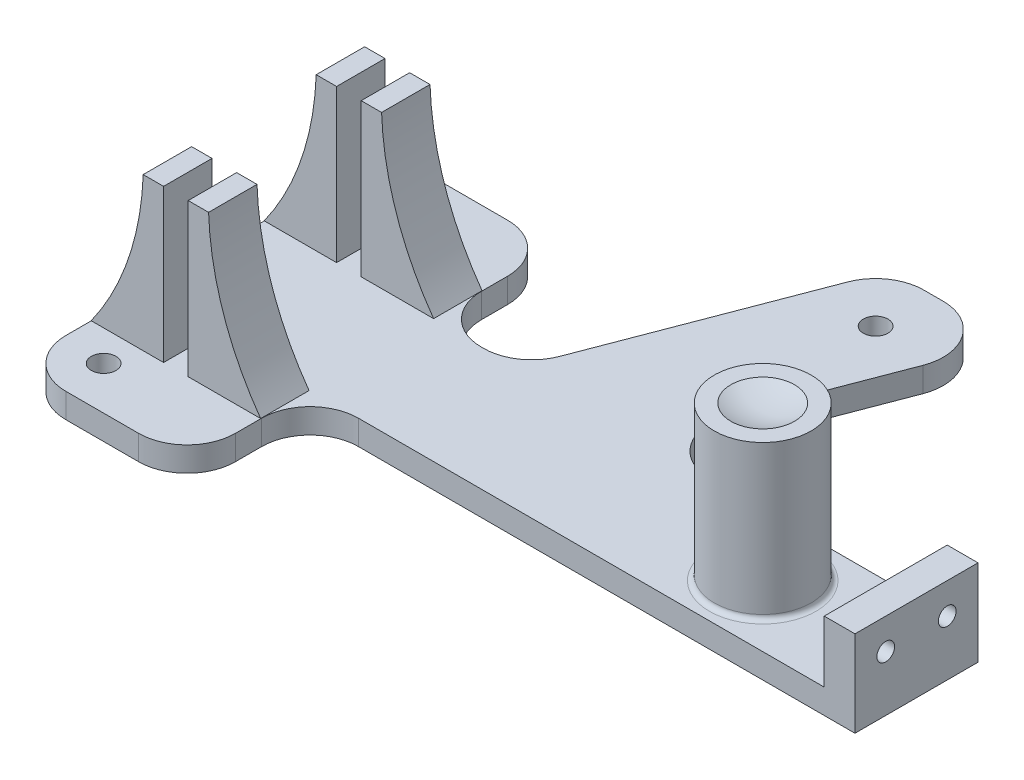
from build123d import *

# Parameters (mm, degrees)
BOSS_EXTRUDE1_DEPTH       = 5.08
BOSS_EXTRUDE2_DEPTH       = 10
SKETCH3_R                 = 10
BOSS_EXTRUDE3_DEPTH       = 31.75
FILLET1_R                 = 1
BOSS_EXTRUDE5_DEPTH       = 5.08
FILLET2_R                 = 10
FILLET3_R                 = 10
SKETCH9_W                 = 6.35
SKETCH9_H                 = 25.4
BOSS_EXTRUDE6_DEPTH       = 12.7
F_6_CLEARANCE_HOLE1_D     = 3.6576
F_6_CLEARANCE_HOLE1_DEPTH = 6.35
CUT_EXTRUDE1_REACH        = 155.752
SKETCH17_R                = 2.54


with BuildPart() as part:
    # Sketch1 → Boss-Extrude1 (new body)
    with BuildSketch(Plane(origin=(0, 0, 0), x_dir=(1, 0, 0), z_dir=(0, 1, 0))):
        with BuildLine():
            Line((20.08, 28.1), (20.08, 22.7))
            ThreePointArc((20.08, 22.7), (23.008932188, 15.628932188), (30.08, 12.7))
            Line((30.08, 12.7), (126.24, 12.7))
            Line((126.24, 12.7), (132.59, 12.7))
            Line((132.59, 12.7), (132.59, 0))
            Line((132.59, 0), (132.59, -12.7))
            Line((132.59, -12.7), (126.24, -12.7))
            Line((126.24, -12.7), (30.08, -12.7))
            ThreePointArc((30.08, -12.7), (23.008932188, -15.628932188), (20.08, -22.7))
            Line((20.08, -22.7), (20.08, -28.1))
            ThreePointArc((20.08, -28.1), (17.151067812, -35.171067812), (10.08, -38.1))
            Line((10.08, -38.1), (-4.92, -38.1))
            ThreePointArc((-4.92, -38.1), (-11.991067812, -35.171067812), (-14.92, -28.1))
            Line((-14.92, -28.1), (-14.92, 28.1))
            ThreePointArc((-14.92, 28.1), (-11.991067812, 35.171067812), (-4.92, 38.1))
            Line((-4.92, 38.1), (10.08, 38.1))
            ThreePointArc((10.08, 38.1), (17.151067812, 35.171067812), (20.08, 28.1))
        make_face()
    extrude(amount=-BOSS_EXTRUDE1_DEPTH)

    # Sketch2 → Boss-Extrude2 (add)
    with BuildSketch(Plane.XY.offset(22.86)):
        with BuildLine():
            Line((0, 0), (-14.953299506, 0))
            ThreePointArc((-14.953299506, 0), (-7.255141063, 14.95657571), (-4.209502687, 31.5))
            Line((-4.209502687, 31.5), (0, 31.5))
            Line((0, 31.5), (0, 0))
        make_face()
        with BuildLine():
            Line((5.08, 0), (20.033299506, 0))
            ThreePointArc((20.033299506, 0), (12.335141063, 14.95657571), (9.289502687, 31.5))
            Line((9.289502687, 31.5), (5.08, 31.5))
            Line((5.08, 31.5), (5.08, 0))
        make_face()
    boss_extrude2 = extrude(amount=-BOSS_EXTRUDE2_DEPTH)

    # Mirror1: Boss-Extrude2 across plane
    add(boss_extrude2.mirror(Plane.XY))

    # Sketch3 → Boss-Extrude3 (add)
    with BuildSketch(Plane(origin=(0, 0, 0), x_dir=(1, 0, 0), z_dir=(0, 1, 0))):
        with Locations(Location((100.84, 0, 0), (0, 0, 270))):
            Circle(SKETCH3_R)
    extrude(amount=BOSS_EXTRUDE3_DEPTH)

    # Fillet1
    fillet1_edges = [part.edges().sort_by_distance(p)[0] for p in [
        (100.84, 0, -10),
    ]]
    fillet(fillet1_edges, radius=FILLET1_R)

    # Sketch4 → Cut-Revolve1 (revolve, cut)
    with BuildSketch(Plane.XY):
        with BuildLine():
            Line((100.84, 31.75), (107.399510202, 31.75))
            ThreePointArc((107.399510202, 31.75), (104.189414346, 30.733638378), (100.84, 30.3884864))
            Line((100.84, 30.3884864), (100.84, 31.75))
        make_face()
    revolve(axis=Axis((100.84, 31.75, 0), (0, -1, 0)), mode=Mode.SUBTRACT)

    # Sketch8 → Boss-Extrude5 (add)
    with BuildSketch(Plane(origin=(0, 0, 0), x_dir=(1, 0, 0), z_dir=(0, 1, 0))):
        with BuildLine():
            Line((37.34, 12.7), (56.207184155, 62.145063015))
            ThreePointArc((56.207184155, 62.145063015), (59.87783999, 66.815612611), (65.550113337, 68.58))
            Line((65.550113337, 68.58), (69.543550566, 68.58))
            ThreePointArc((69.543550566, 68.58), (77.779163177, 64.252273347), (78.886479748, 55.014936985))
            Line((78.886479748, 55.014936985), (62.74, 12.7))
            Line((62.74, 12.7), (37.34, 12.7))
        make_face()
    extrude(amount=-BOSS_EXTRUDE5_DEPTH)

    # Fillet2
    fillet2_edges = [part.edges().sort_by_distance(p)[0] for p in [
        (37.34, -2.54, -12.7),
    ]]
    fillet(fillet2_edges, radius=FILLET2_R)

    # Fillet3
    fillet3_edges = [part.edges().sort_by_distance(p)[0] for p in [
        (62.74, -2.54, -12.7),
    ]]
    fillet(fillet3_edges, radius=FILLET3_R)

    # Sketch9 → Boss-Extrude6 (add)
    with BuildSketch(Plane(origin=(0, 0, 0), x_dir=(1, 0, 0), z_dir=(0, 1, 0))):
        with Locations((129.415, 0)):
            Rectangle(SKETCH9_W, SKETCH9_H)
    extrude(amount=BOSS_EXTRUDE6_DEPTH)

    # 6 Clearance Hole1
    with Locations(Plane(origin=(132.59, 0, 0), x_dir=(0, 0, -1), z_dir=(1, 0, 0))):
        with Locations((6.35, 6.35), (-6.35, 6.35)):
            Hole(F_6_CLEARANCE_HOLE1_D / 2, depth=F_6_CLEARANCE_HOLE1_DEPTH)

    # Sketch17 → Cut-Extrude1 (cut, up to next)
    with BuildSketch(Plane.XZ.offset(5.08), mode=Mode.PRIVATE) as cut_extrude1_sk1:
        with Locations(Location((-6.03, 29.21, 0), (0, 0, 270))):
            Circle(SKETCH17_R)
    cut_extrude1_tool1 = extrude(cut_extrude1_sk1.sketch, amount=-CUT_EXTRUDE1_REACH, mode=Mode.PRIVATE) & part.part
    # Sketch17 → Cut-Extrude1 (cut, up to next)
    with BuildSketch(Plane.XZ.offset(5.08), mode=Mode.PRIVATE) as cut_extrude1_sk2:
        with Locations(Location((-6.03, -29.21, 0), (0, 0, 90))):
            Circle(SKETCH17_R)
    cut_extrude1_tool2 = extrude(cut_extrude1_sk2.sketch, amount=-CUT_EXTRUDE1_REACH, mode=Mode.PRIVATE) & part.part
    # Sketch17 → Cut-Extrude1 (cut, up to next)
    with BuildSketch(Plane.XZ.offset(5.08), mode=Mode.PRIVATE) as cut_extrude1_sk3:
        with Locations(Location((67.001174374, -57.15, 0), (0, 0, 270))):
            Circle(SKETCH17_R)
    cut_extrude1_tool3 = extrude(cut_extrude1_sk3.sketch, amount=-CUT_EXTRUDE1_REACH, mode=Mode.PRIVATE) & part.part
    # Sketch17 → Cut-Extrude1 (cut, up to next)
    with BuildSketch(Plane.XZ.offset(5.08), mode=Mode.PRIVATE) as cut_extrude1_sk4:
        with Locations(Location((118.62, 0, 0), (0, 0, 270))):
            Circle(SKETCH17_R)
    cut_extrude1_tool4 = extrude(cut_extrude1_sk4.sketch, amount=-CUT_EXTRUDE1_REACH, mode=Mode.PRIVATE) & part.part
    add(cut_extrude1_tool1.solids().sort_by_distance((-6.03, -5.08, 29.21))[0], mode=Mode.SUBTRACT)
    add(cut_extrude1_tool2.solids().sort_by_distance((-6.03, -5.08, -29.21))[0], mode=Mode.SUBTRACT)
    add(cut_extrude1_tool3.solids().sort_by_distance((67.001174, -5.08, -57.15))[0], mode=Mode.SUBTRACT)
    add(cut_extrude1_tool4.solids().sort_by_distance((118.62, -5.08, 0))[0], mode=Mode.SUBTRACT)


solid = part.part
